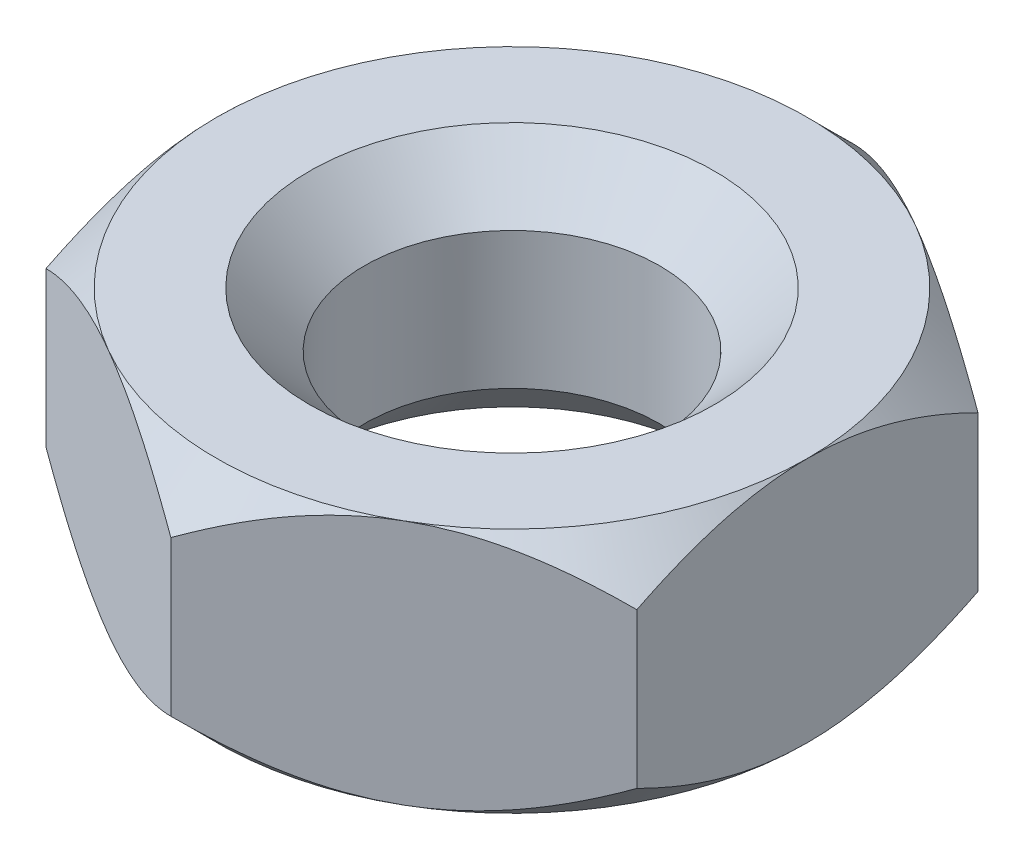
ISO-10303-21;
HEADER;
FILE_DESCRIPTION(('STEP AP214'),'2;1');
FILE_NAME('part.step','',(''),(''),'','','');
FILE_SCHEMA(('AUTOMOTIVE_DESIGN { 1 0 10303 214 1 1 1 1 }'));
ENDSEC;
DATA;
#1=APPLICATION_CONTEXT('core data for automotive mechanical design processes');
#2=APPLICATION_PROTOCOL_DEFINITION('international standard','automotive_design',2000,#1);
#3=PRODUCT_CONTEXT('',#1,'mechanical');
#4=PRODUCT('Part','Part','',(#3));
#5=PRODUCT_RELATED_PRODUCT_CATEGORY('part','',(#4));
#6=PRODUCT_DEFINITION_FORMATION('','',#4);
#7=PRODUCT_DEFINITION_CONTEXT('part definition',#1,'design');
#8=PRODUCT_DEFINITION('design','',#6,#7);
#9=PRODUCT_DEFINITION_SHAPE('','',#8);
#10=(LENGTH_UNIT() NAMED_UNIT(*) SI_UNIT(.MILLI.,.METRE.));
#11=(NAMED_UNIT(*) PLANE_ANGLE_UNIT() SI_UNIT($,.RADIAN.));
#12=(NAMED_UNIT(*) SI_UNIT($,.STERADIAN.) SOLID_ANGLE_UNIT());
#13=UNCERTAINTY_MEASURE_WITH_UNIT(LENGTH_MEASURE(1.E-05),#10,'distance_accuracy_value','');
#14=(GEOMETRIC_REPRESENTATION_CONTEXT(3) GLOBAL_UNCERTAINTY_ASSIGNED_CONTEXT((#13)) GLOBAL_UNIT_ASSIGNED_CONTEXT((#10,
#11,#12)) REPRESENTATION_CONTEXT('',''));
#15=CARTESIAN_POINT('',(0.,0.,0.));
#16=DIRECTION('',(0.,0.,1.));
#17=DIRECTION('',(1.,0.,0.));
#18=AXIS2_PLACEMENT_3D('',#15,#16,#17);
#19=CARTESIAN_POINT('',(0.,0.70480239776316,0.));
#20=DIRECTION('',(0.,-1.,0.));
#21=DIRECTION('',(0.,0.,-1.));
#22=AXIS2_PLACEMENT_3D('',#19,#20,#21);
#23=CONICAL_SURFACE('',#22,3.12019760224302,0.785398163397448);
#24=CARTESIAN_POINT('',(-1.22558165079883E-08,0.707308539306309,3.11769146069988));
#25=CARTESIAN_POINT('',(0.0933927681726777,0.761178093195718,3.06377111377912));
#26=CARTESIAN_POINT('',(0.188364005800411,0.811865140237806,3.00893944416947));
#27=CARTESIAN_POINT('',(0.382092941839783,0.904619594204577,2.89708999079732));
#28=CARTESIAN_POINT('',(0.480870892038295,0.946630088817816,2.84006051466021));
#29=CARTESIAN_POINT('',(0.678736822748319,1.01797353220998,2.72582256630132));
#30=CARTESIAN_POINT('',(0.777732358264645,1.04763944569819,2.6686674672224));
#31=CARTESIAN_POINT('',(0.977847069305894,1.09334614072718,2.55313118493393));
#32=CARTESIAN_POINT('',(1.07895877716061,1.10942854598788,2.49475431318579));
#33=CARTESIAN_POINT('',(1.20863181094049,1.12026667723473,2.41988755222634));
#34=CARTESIAN_POINT('',(1.23681517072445,1.12203543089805,2.4036158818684));
#35=CARTESIAN_POINT('',(1.29333046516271,1.12440395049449,2.37098676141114));
#36=CARTESIAN_POINT('',(1.32166254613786,1.12499905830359,2.35462922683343));
#37=CARTESIAN_POINT('',(1.35,1.12500000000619,2.33826859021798));
#38=B_SPLINE_CURVE_WITH_KNOTS('',3,(#24,#25,#26,#27,#28,#29,#30,#31,#32,#33,#34,#35,#36,#37),
.UNSPECIFIED.,.F.,.F.,(4,2,2,2,2,2,4),(0.,0.361907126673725,0.726117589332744,1.0797429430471,
1.43228071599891,1.5300396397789,1.6281857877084),.UNSPECIFIED.);
#39=CARTESIAN_POINT('',(-3.06182851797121E-08,0.707308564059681,3.1176914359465));
#40=VERTEX_POINT('',#39);
#41=CARTESIAN_POINT('',(1.35000000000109,1.125000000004,2.33826859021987));
#42=VERTEX_POINT('',#41);
#43=EDGE_CURVE('E123',#40,#42,#38,.T.);
#44=ORIENTED_EDGE('',*,*,#43,.T.);
#45=CARTESIAN_POINT('',(0.,1.12500000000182,0.));
#46=DIRECTION('',(0.,-1.,0.));
#47=DIRECTION('',(0.,0.,-1.));
#48=AXIS2_PLACEMENT_3D('',#45,#46,#47);
#49=CIRCLE('',#48,2.70000000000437);
#50=CARTESIAN_POINT('',(-1.35000000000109,1.125000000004,2.33826859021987));
#51=VERTEX_POINT('',#50);
#52=EDGE_CURVE('E130',#51,#42,#49,.F.);
#53=ORIENTED_EDGE('',*,*,#52,.F.);
#54=CARTESIAN_POINT('',(-1.35,1.12500000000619,2.33826859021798));
#55=CARTESIAN_POINT('',(-1.31408670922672,1.12500332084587,2.35900313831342));
#56=CARTESIAN_POINT('',(-1.27817878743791,1.12404413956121,2.37973458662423));
#57=CARTESIAN_POINT('',(-1.20644389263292,1.12023205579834,2.42115074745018));
#58=CARTESIAN_POINT('',(-1.17061690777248,1.11737945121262,2.44183546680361));
#59=CARTESIAN_POINT('',(-1.06348700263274,1.10604290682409,2.5036869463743));
#60=CARTESIAN_POINT('',(-0.992392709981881,1.09477998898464,2.54473325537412));
#61=CARTESIAN_POINT('',(-0.852359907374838,1.06566055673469,2.62558123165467));
#62=CARTESIAN_POINT('',(-0.783405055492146,1.04790604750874,2.66539233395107));
#63=CARTESIAN_POINT('',(-0.646803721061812,1.00657553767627,2.74425915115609));
#64=CARTESIAN_POINT('',(-0.579157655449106,0.982997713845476,2.7833146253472));
#65=CARTESIAN_POINT('',(-0.468526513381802,0.93991195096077,2.84718754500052));
#66=CARTESIAN_POINT('',(-0.4251183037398,0.921824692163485,2.87224928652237));
#67=CARTESIAN_POINT('',(-0.338937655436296,0.88376152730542,2.92200570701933));
#68=CARTESIAN_POINT('',(-0.296165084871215,0.863786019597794,2.94670046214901));
#69=CARTESIAN_POINT('',(-0.210800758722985,0.821942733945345,2.99598557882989));
#70=CARTESIAN_POINT('',(-0.16821544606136,0.800057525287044,3.0205722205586));
#71=CARTESIAN_POINT('',(-0.08365611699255,0.754771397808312,3.06939257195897));
#72=CARTESIAN_POINT('',(-0.0416820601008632,0.731370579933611,3.09362630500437));
#73=CARTESIAN_POINT('',(-6.12365688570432E-08,0.707308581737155,3.11769141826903));
#74=B_SPLINE_CURVE_WITH_KNOTS('',3,(#54,#55,#56,#57,#58,#59,#60,#61,#62,#63,#64,#65,#66,#67,#68,
#69,#70,#71,#72,#73),.UNSPECIFIED.,.F.,.F.,(4,2,2,2,2,2,2,2,2,4),(0.,0.124384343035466,
0.24874912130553,0.496987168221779,0.741481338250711,0.986052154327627,1.14587741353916,
1.30566903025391,1.46711292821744,1.62854608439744),.UNSPECIFIED.);
#75=EDGE_CURVE('E18',#51,#40,#74,.T.);
#76=ORIENTED_EDGE('',*,*,#75,.T.);
#77=EDGE_LOOP('',(#44,#53,#76));
#78=FACE_BOUND('',#77,.T.);
#79=ADVANCED_FACE('F14',(#78),#23,.T.);
#80=CARTESIAN_POINT('',(0.,0.70480239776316,0.));
#81=DIRECTION('',(0.,-1.,0.));
#82=DIRECTION('',(0.,0.,-1.));
#83=AXIS2_PLACEMENT_3D('',#80,#81,#82);
#84=CONICAL_SURFACE('',#83,3.12019760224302,0.785398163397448);
#85=CARTESIAN_POINT('',(2.70000001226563,0.70730853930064,-1.55884571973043));
#86=CARTESIAN_POINT('',(2.60660723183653,0.761178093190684,-1.61276606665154));
#87=CARTESIAN_POINT('',(2.51163599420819,0.811865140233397,-1.66759773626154));
#88=CARTESIAN_POINT('',(2.31790705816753,0.904619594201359,-1.77944718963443));
#89=CARTESIAN_POINT('',(2.21912910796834,0.946630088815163,-1.83647666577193));
#90=CARTESIAN_POINT('',(2.02126317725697,1.01797353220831,-1.9507146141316));
#91=CARTESIAN_POINT('',(1.92226764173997,1.04763944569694,-2.00786971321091));
#92=CARTESIAN_POINT('',(1.72215293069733,1.09334614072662,-2.12340599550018));
#93=CARTESIAN_POINT('',(1.62104122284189,1.10942854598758,-2.18178286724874));
#94=CARTESIAN_POINT('',(1.49136818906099,1.12026667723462,-2.25664962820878));
#95=CARTESIAN_POINT('',(1.46318482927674,1.12203543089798,-2.27292129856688));
#96=CARTESIAN_POINT('',(1.40666953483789,1.12440395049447,-2.30555041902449));
#97=CARTESIAN_POINT('',(1.37833745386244,1.12499905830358,-2.32190795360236));
#98=CARTESIAN_POINT('',(1.35,1.12500000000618,-2.33826859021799));
#99=B_SPLINE_CURVE_WITH_KNOTS('',3,(#85,#86,#87,#88,#89,#90,#91,#92,#93,#94,#95,#96,#97,#98),
.UNSPECIFIED.,.F.,.F.,(4,2,2,2,2,2,4),(0.,0.361907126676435,0.726117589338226,1.07974294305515,
1.43228071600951,1.53003963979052,1.62818578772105),.UNSPECIFIED.);
#100=CARTESIAN_POINT('',(2.7,0.707308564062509,-1.55884569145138));
#101=VERTEX_POINT('',#100);
#102=CARTESIAN_POINT('',(1.35000000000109,1.125000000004,-2.33826859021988));
#103=VERTEX_POINT('',#102);
#104=EDGE_CURVE('E177',#101,#103,#99,.T.);
#105=ORIENTED_EDGE('',*,*,#104,.T.);
#106=CARTESIAN_POINT('',(0.,1.12500000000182,0.));
#107=DIRECTION('',(0.,-1.,0.));
#108=DIRECTION('',(0.,0.,-1.));
#109=AXIS2_PLACEMENT_3D('',#106,#107,#108);
#110=CIRCLE('',#109,2.70000000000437);
#111=CARTESIAN_POINT('',(2.70000000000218,1.125000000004,0.));
#112=VERTEX_POINT('',#111);
#113=EDGE_CURVE('E137',#112,#103,#110,.F.);
#114=ORIENTED_EDGE('',*,*,#113,.F.);
#115=CARTESIAN_POINT('',(2.7,1.12500000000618,0.));
#116=CARTESIAN_POINT('',(2.7,1.12500332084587,-0.0414690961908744));
#117=CARTESIAN_POINT('',(2.7,1.12404413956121,-0.0829319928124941));
#118=CARTESIAN_POINT('',(2.7,1.12023205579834,-0.165764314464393));
#119=CARTESIAN_POINT('',(2.7,1.11737945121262,-0.207133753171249));
#120=CARTESIAN_POINT('',(2.7,1.10604290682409,-0.330836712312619));
#121=CARTESIAN_POINT('',(2.7,1.09477998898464,-0.412929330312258));
#122=CARTESIAN_POINT('',(2.7,1.06566055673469,-0.574625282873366));
#123=CARTESIAN_POINT('',(2.7,1.04790604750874,-0.654247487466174));
#124=CARTESIAN_POINT('',(2.7,1.00657553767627,-0.811981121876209));
#125=CARTESIAN_POINT('',(2.7,0.982997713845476,-0.890092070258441));
#126=CARTESIAN_POINT('',(2.7,0.93991195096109,-1.01783790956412));
#127=CARTESIAN_POINT('',(2.7,0.921824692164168,-1.06796139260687));
#128=CARTESIAN_POINT('',(2.7,0.883761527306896,-1.16747423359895));
#129=CARTESIAN_POINT('',(2.7,0.863786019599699,-1.2168637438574));
#130=CARTESIAN_POINT('',(2.7,0.821942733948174,-1.31543397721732));
#131=CARTESIAN_POINT('',(2.7,0.800057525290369,-1.36460726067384));
#132=CARTESIAN_POINT('',(2.7,0.754771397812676,-1.46224796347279));
#133=CARTESIAN_POINT('',(2.7,0.731370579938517,-1.5107154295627));
#134=CARTESIAN_POINT('',(2.7,0.707308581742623,-1.55884565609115));
#135=B_SPLINE_CURVE_WITH_KNOTS('',3,(#115,#116,#117,#118,#119,#120,#121,#122,#123,#124,#125,
#126,#127,#128,#129,#130,#131,#132,#133,#134),.UNSPECIFIED.,.F.,.F.,(4,2,2,2,2,2,2,2,2,4),(0.,
0.124384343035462,0.248749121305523,0.496987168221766,0.741481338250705,0.986052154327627,
1.14587741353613,1.30566903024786,1.4671129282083,1.62854608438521),.UNSPECIFIED.);
#136=EDGE_CURVE('E571',#112,#101,#135,.T.);
#137=ORIENTED_EDGE('',*,*,#136,.T.);
#138=EDGE_LOOP('',(#105,#114,#137));
#139=FACE_BOUND('',#138,.T.);
#140=ADVANCED_FACE('F164',(#139),#84,.T.);
#141=CARTESIAN_POINT('',(0.,0.70480239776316,0.));
#142=DIRECTION('',(0.,-1.,0.));
#143=DIRECTION('',(0.,0.,-1.));
#144=AXIS2_PLACEMENT_3D('',#141,#142,#143);
#145=CONICAL_SURFACE('',#144,3.12019760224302,0.785398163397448);
#146=CARTESIAN_POINT('',(-2.7,0.707308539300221,-1.55884574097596));
#147=CARTESIAN_POINT('',(-2.7,0.761178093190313,-1.4510050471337));
#148=CARTESIAN_POINT('',(-2.7,0.811865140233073,-1.34134170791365));
#149=CARTESIAN_POINT('',(-2.7,0.904619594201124,-1.11764280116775));
#150=CARTESIAN_POINT('',(-2.7,0.946630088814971,-1.00358384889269));
#151=CARTESIAN_POINT('',(-2.7,1.01797353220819,-0.775107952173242));
#152=CARTESIAN_POINT('',(-2.7,1.04763944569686,-0.66079775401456));
#153=CARTESIAN_POINT('',(-2.7,1.09334614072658,-0.429725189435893));
#154=CARTESIAN_POINT('',(-2.7,1.10942854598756,-0.312971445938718));
#155=CARTESIAN_POINT('',(-2.7,1.12026667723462,-0.163237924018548));
#156=CARTESIAN_POINT('',(-2.7,1.12203543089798,-0.130694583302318));
#157=CARTESIAN_POINT('',(-2.7,1.12440395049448,-0.0654363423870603));
#158=CARTESIAN_POINT('',(-2.7,1.12499905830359,-0.0327212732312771));
#159=CARTESIAN_POINT('',(-2.7,1.12500000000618,0.));
#160=B_SPLINE_CURVE_WITH_KNOTS('',3,(#146,#147,#148,#149,#150,#151,#152,#153,#154,#155,#156,
#157,#158,#159),.UNSPECIFIED.,.F.,.F.,(4,2,2,2,2,2,4),(0.,0.361907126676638,0.726117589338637,
1.07974294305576,1.43228071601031,1.53003963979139,1.628185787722),.UNSPECIFIED.);
#161=CARTESIAN_POINT('',(-2.69999996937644,0.707308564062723,-1.55884574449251));
#162=VERTEX_POINT('',#161);
#163=CARTESIAN_POINT('',(-2.70000000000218,1.125000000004,0.));
#164=VERTEX_POINT('',#163);
#165=EDGE_CURVE('E113',#162,#164,#160,.T.);
#166=ORIENTED_EDGE('',*,*,#165,.T.);
#167=CARTESIAN_POINT('',(0.,1.12500000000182,0.));
#168=DIRECTION('',(0.,-1.,0.));
#169=DIRECTION('',(0.,0.,-1.));
#170=AXIS2_PLACEMENT_3D('',#167,#168,#169);
#171=CIRCLE('',#170,2.70000000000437);
#172=CARTESIAN_POINT('',(-1.35000000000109,1.125000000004,-2.33826859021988));
#173=VERTEX_POINT('',#172);
#174=EDGE_CURVE('E134',#173,#164,#171,.F.);
#175=ORIENTED_EDGE('',*,*,#174,.F.);
#176=CARTESIAN_POINT('',(-1.35,1.12500000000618,-2.33826859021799));
#177=CARTESIAN_POINT('',(-1.38591329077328,1.12500332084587,-2.31753404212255));
#178=CARTESIAN_POINT('',(-1.42182121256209,1.12404413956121,-2.29680259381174));
#179=CARTESIAN_POINT('',(-1.49355610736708,1.12023205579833,-2.25538643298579));
#180=CARTESIAN_POINT('',(-1.52938309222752,1.11737945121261,-2.23470171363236));
#181=CARTESIAN_POINT('',(-1.63651299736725,1.10604290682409,-2.17285023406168));
#182=CARTESIAN_POINT('',(-1.70760729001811,1.09477998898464,-2.13180392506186));
#183=CARTESIAN_POINT('',(-1.84764009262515,1.06566055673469,-2.05095594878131));
#184=CARTESIAN_POINT('',(-1.91659494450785,1.04790604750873,-2.0111448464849));
#185=CARTESIAN_POINT('',(-2.05319627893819,1.00657553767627,-1.93227802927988));
#186=CARTESIAN_POINT('',(-2.12084234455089,0.982997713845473,-1.89322255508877));
#187=CARTESIAN_POINT('',(-2.23147348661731,0.939911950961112,-1.82934963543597));
#188=CARTESIAN_POINT('',(-2.27488169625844,0.921824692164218,-1.80428789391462));
#189=CARTESIAN_POINT('',(-2.36106234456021,0.883761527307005,-1.75453147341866));
#190=CARTESIAN_POINT('',(-2.40383491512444,0.863786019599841,-1.72983671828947));
#191=CARTESIAN_POINT('',(-2.48919924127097,0.821942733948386,-1.68055160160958));
#192=CARTESIAN_POINT('',(-2.53178455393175,0.800057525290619,-1.65596495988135));
#193=CARTESIAN_POINT('',(-2.61634388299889,0.754771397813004,-1.60714460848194));
#194=CARTESIAN_POINT('',(-2.65831793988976,0.731370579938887,-1.58291087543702));
#195=CARTESIAN_POINT('',(-2.69999993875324,0.707308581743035,-1.55884576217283));
#196=B_SPLINE_CURVE_WITH_KNOTS('',3,(#176,#177,#178,#179,#180,#181,#182,#183,#184,#185,#186,
#187,#188,#189,#190,#191,#192,#193,#194,#195),.UNSPECIFIED.,.F.,.F.,(4,2,2,2,2,2,2,2,2,4),(0.,
0.124384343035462,0.248749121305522,0.496987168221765,0.741481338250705,0.986052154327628,
1.1458774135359,1.3056690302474,1.46711292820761,1.62854608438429),.UNSPECIFIED.);
#197=EDGE_CURVE('E172',#173,#162,#196,.T.);
#198=ORIENTED_EDGE('',*,*,#197,.T.);
#199=EDGE_LOOP('',(#166,#175,#198));
#200=FACE_BOUND('',#199,.T.);
#201=ADVANCED_FACE('F159',(#200),#145,.T.);
#202=CARTESIAN_POINT('',(0.,0.70480239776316,0.));
#203=DIRECTION('',(0.,-1.,0.));
#204=DIRECTION('',(0.,0.,-1.));
#205=AXIS2_PLACEMENT_3D('',#202,#203,#204);
#206=CONICAL_SURFACE('',#205,3.12019760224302,0.785398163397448);
#207=CARTESIAN_POINT('',(0.,1.12500000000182,0.));
#208=DIRECTION('',(0.,-1.,0.));
#209=DIRECTION('',(0.,0.,-1.));
#210=AXIS2_PLACEMENT_3D('',#207,#208,#209);
#211=CIRCLE('',#210,2.70000000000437);
#212=EDGE_CURVE('E108',#164,#51,#211,.F.);
#213=ORIENTED_EDGE('',*,*,#212,.F.);
#214=CARTESIAN_POINT('',(-2.7,1.12500000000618,0.));
#215=CARTESIAN_POINT('',(-2.7,1.12500332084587,0.0414690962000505));
#216=CARTESIAN_POINT('',(-2.7,1.12404413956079,0.0829319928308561));
#217=CARTESIAN_POINT('',(-2.7,1.12023205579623,0.16576431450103));
#218=CARTESIAN_POINT('',(-2.7,1.11737945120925,0.207133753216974));
#219=CARTESIAN_POINT('',(-2.7,1.10604290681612,0.330836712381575));
#220=CARTESIAN_POINT('',(-2.7,1.09477998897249,0.412929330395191));
#221=CARTESIAN_POINT('',(-2.7,1.06566055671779,0.574625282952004));
#222=CARTESIAN_POINT('',(-2.7,1.04790604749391,0.654247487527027));
#223=CARTESIAN_POINT('',(-2.7,1.00657553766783,0.811981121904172));
#224=CARTESIAN_POINT('',(-2.7,0.982997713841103,0.89009207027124));
#225=CARTESIAN_POINT('',(-2.7,0.939911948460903,1.01783791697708));
#226=CARTESIAN_POINT('',(-2.7,0.921824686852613,1.06796140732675));
#227=CARTESIAN_POINT('',(-2.7,0.883761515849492,1.16747426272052));
#228=CARTESIAN_POINT('',(-2.7,0.863786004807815,1.21686378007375));
#229=CARTESIAN_POINT('',(-2.7,0.821942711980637,1.31543402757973));
#230=CARTESIAN_POINT('',(-2.7,0.800057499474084,1.36460731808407));
#231=CARTESIAN_POINT('',(-2.7,0.754771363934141,1.46224803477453));
#232=CARTESIAN_POINT('',(-2.7,0.731370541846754,1.51071550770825));
#233=CARTESIAN_POINT('',(-2.7,0.707308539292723,1.55884574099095));
#234=B_SPLINE_CURVE_WITH_KNOTS('',3,(#214,#215,#216,#217,#218,#219,#220,#221,#222,#223,#224,
#225,#226,#227,#228,#229,#230,#231,#232,#233),.UNSPECIFIED.,.F.,.F.,(4,2,2,2,2,2,2,2,2,4),(0.,
0.124384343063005,0.248749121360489,0.49698716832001,0.741481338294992,0.986052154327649,
1.14587743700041,1.30566907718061,1.46711299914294,1.62854617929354),.UNSPECIFIED.);
#235=CARTESIAN_POINT('',(-2.7,0.707308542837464,1.55884573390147));
#236=VERTEX_POINT('',#235);
#237=EDGE_CURVE('E110',#164,#236,#234,.T.);
#238=ORIENTED_EDGE('',*,*,#237,.T.);
#239=CARTESIAN_POINT('',(-2.69999993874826,0.707308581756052,1.55884576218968));
#240=CARTESIAN_POINT('',(-2.60660716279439,0.761178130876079,1.61276610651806));
#241=CARTESIAN_POINT('',(-2.51163592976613,0.811865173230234,1.66759777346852));
#242=CARTESIAN_POINT('',(-2.31790700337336,0.904619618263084,1.77944722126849));
#243=CARTESIAN_POINT('',(-2.21912905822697,0.946630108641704,1.83647669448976));
#244=CARTESIAN_POINT('',(-2.02126313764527,1.01797354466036,1.95071463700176));
#245=CARTESIAN_POINT('',(-1.9222676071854,1.04763945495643,2.00786973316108));
#246=CARTESIAN_POINT('',(-1.72215290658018,1.09334614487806,2.12340600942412));
#247=CARTESIAN_POINT('',(-1.62104120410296,1.10942854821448,2.18178287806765));
#248=CARTESIAN_POINT('',(-1.49136817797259,1.12026667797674,2.25664963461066));
#249=CARTESIAN_POINT('',(-1.46318482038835,1.12203543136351,2.27292130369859));
#250=CARTESIAN_POINT('',(-1.40666953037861,1.12440395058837,2.30555042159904));
#251=CARTESIAN_POINT('',(-1.37833745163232,1.12499905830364,2.32190795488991));
#252=CARTESIAN_POINT('',(-1.35,1.12500000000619,2.33826859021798));
#253=B_SPLINE_CURVE_WITH_KNOTS('',3,(#239,#240,#241,#242,#243,#244,#245,#246,#247,#248,#249,
#250,#251,#252),.UNSPECIFIED.,.F.,.F.,(4,2,2,2,2,2,4),(0.,0.361907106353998,0.726117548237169,
1.07974288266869,1.43228063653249,1.53003955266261,1.62818569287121),.UNSPECIFIED.);
#254=EDGE_CURVE('E104',#236,#51,#253,.T.);
#255=ORIENTED_EDGE('',*,*,#254,.T.);
#256=EDGE_LOOP('',(#213,#238,#255));
#257=FACE_BOUND('',#256,.T.);
#258=ADVANCED_FACE('F106',(#257),#206,.T.);
#259=CARTESIAN_POINT('',(0.,1.125,0.));
#260=DIRECTION('',(0.,1.,0.));
#261=DIRECTION('',(0.,0.,1.));
#262=AXIS2_PLACEMENT_3D('',#259,#260,#261);
#263=PLANE('',#262);
#264=ORIENTED_EDGE('',*,*,#174,.T.);
#265=ORIENTED_EDGE('',*,*,#212,.T.);
#266=ORIENTED_EDGE('',*,*,#52,.T.);
#267=CARTESIAN_POINT('',(0.,1.12500000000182,0.));
#268=DIRECTION('',(0.,-1.,0.));
#269=DIRECTION('',(0.,0.,-1.));
#270=AXIS2_PLACEMENT_3D('',#267,#268,#269);
#271=CIRCLE('',#270,2.70000000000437);
#272=EDGE_CURVE('E337',#112,#42,#271,.T.);
#273=ORIENTED_EDGE('',*,*,#272,.F.);
#274=ORIENTED_EDGE('',*,*,#113,.T.);
#275=CARTESIAN_POINT('',(0.,1.12500000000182,0.));
#276=DIRECTION('',(0.,-1.,0.));
#277=DIRECTION('',(0.,0.,-1.));
#278=AXIS2_PLACEMENT_3D('',#275,#276,#277);
#279=CIRCLE('',#278,2.70000000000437);
#280=EDGE_CURVE('E421',#173,#103,#279,.T.);
#281=ORIENTED_EDGE('',*,*,#280,.F.);
#282=EDGE_LOOP('',(#264,#265,#266,#273,#274,#281));
#283=FACE_BOUND('',#282,.T.);
#284=CARTESIAN_POINT('',(0.,1.12499999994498,0.));
#285=DIRECTION('',(0.,1.,0.));
#286=DIRECTION('',(0.,0.,1.));
#287=AXIS2_PLACEMENT_3D('',#284,#285,#286);
#288=CIRCLE('',#287,1.8500000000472);
#289=CARTESIAN_POINT('',(0.,1.12499999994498,1.8500000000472));
#290=VERTEX_POINT('',#289);
#291=EDGE_CURVE('E135',#290,#290,#288,.F.);
#292=ORIENTED_EDGE('',*,*,#291,.T.);
#293=EDGE_LOOP('',(#292));
#294=FACE_BOUND('',#293,.T.);
#295=ADVANCED_FACE('F127',(#283,#294),#263,.T.);
#296=CARTESIAN_POINT('',(0.,1.12499999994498,0.));
#297=DIRECTION('',(0.,1.,0.));
#298=DIRECTION('',(0.,0.,1.));
#299=AXIS2_PLACEMENT_3D('',#296,#297,#298);
#300=CONICAL_SURFACE('',#299,1.8500000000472,0.785398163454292);
#301=ORIENTED_EDGE('',*,*,#291,.F.);
#302=EDGE_LOOP('',(#301));
#303=FACE_BOUND('',#302,.T.);
#304=CARTESIAN_POINT('',(0.,0.625000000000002,0.));
#305=DIRECTION('',(0.,-1.,0.));
#306=DIRECTION('',(0.,0.,-1.));
#307=AXIS2_PLACEMENT_3D('',#304,#305,#306);
#308=CIRCLE('',#307,1.35);
#309=CARTESIAN_POINT('',(0.,0.625000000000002,-1.35));
#310=VERTEX_POINT('',#309);
#311=EDGE_CURVE('E335',#310,#310,#308,.T.);
#312=ORIENTED_EDGE('',*,*,#311,.T.);
#313=EDGE_LOOP('',(#312));
#314=FACE_BOUND('',#313,.T.);
#315=ADVANCED_FACE('F234',(#303,#314),#300,.F.);
#316=CARTESIAN_POINT('',(0.,0.70480239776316,0.));
#317=DIRECTION('',(0.,-1.,0.));
#318=DIRECTION('',(0.,0.,-1.));
#319=AXIS2_PLACEMENT_3D('',#316,#317,#318);
#320=CONICAL_SURFACE('',#319,3.12019760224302,0.785398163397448);
#321=ORIENTED_EDGE('',*,*,#280,.T.);
#322=CARTESIAN_POINT('',(1.35,1.12500000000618,-2.33826859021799));
#323=CARTESIAN_POINT('',(1.31408670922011,1.12500332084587,-2.35900313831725));
#324=CARTESIAN_POINT('',(1.27817878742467,1.12404413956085,-2.37973458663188));
#325=CARTESIAN_POINT('',(1.2064438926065,1.12023205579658,-2.42115074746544));
#326=CARTESIAN_POINT('',(1.1706169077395,1.11737945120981,-2.44183546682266));
#327=CARTESIAN_POINT('',(1.06348700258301,1.10604290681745,-2.50368694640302));
#328=CARTESIAN_POINT('',(0.992392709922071,1.09477998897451,-2.54473325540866));
#329=CARTESIAN_POINT('',(0.852359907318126,1.06566055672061,-2.62558123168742));
#330=CARTESIAN_POINT('',(0.783405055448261,1.04790604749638,-2.66539233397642));
#331=CARTESIAN_POINT('',(0.646803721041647,1.00657553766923,-2.74425915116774));
#332=CARTESIAN_POINT('',(0.579157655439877,0.982997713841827,-2.78331462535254));
#333=CARTESIAN_POINT('',(0.468526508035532,0.939911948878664,-2.8471875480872));
#334=CARTESIAN_POINT('',(0.425118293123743,0.921824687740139,-2.87224929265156));
#335=CARTESIAN_POINT('',(0.338937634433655,0.883761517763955,-2.92200571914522));
#336=CARTESIAN_POINT('',(0.296165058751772,0.863786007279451,-2.94670047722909));
#337=CARTESIAN_POINT('',(0.210800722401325,0.821942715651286,-2.99598559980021));
#338=CARTESIAN_POINT('',(0.168215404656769,0.800057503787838,-3.02057224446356));
#339=CARTESIAN_POINT('',(0.0836560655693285,0.754771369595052,-3.06939260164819));
#340=CARTESIAN_POINT('',(0.041682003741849,0.731370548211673,-3.09362633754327));
#341=CARTESIAN_POINT('',(6.34920683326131E-12,0.707308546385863,-3.11769145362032));
#342=B_SPLINE_CURVE_WITH_KNOTS('',3,(#322,#323,#324,#325,#326,#327,#328,#329,#330,#331,#332,
#333,#334,#335,#336,#337,#338,#339,#340,#341),.UNSPECIFIED.,.F.,.F.,(4,2,2,2,2,2,2,2,2,4),(0.,
0.124384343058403,0.248749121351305,0.496987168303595,0.741481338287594,0.986052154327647,
1.14587743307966,1.30566906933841,1.46711298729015,1.62854616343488),.UNSPECIFIED.);
#343=CARTESIAN_POINT('',(0.,0.707308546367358,-3.1176914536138));
#344=VERTEX_POINT('',#343);
#345=EDGE_CURVE('E225',#103,#344,#342,.T.);
#346=ORIENTED_EDGE('',*,*,#345,.T.);
#347=CARTESIAN_POINT('',(-6.34970562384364E-12,0.707308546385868,-3.11769145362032));
#348=CARTESIAN_POINT('',(-0.0933927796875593,0.761178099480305,-3.063771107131));
#349=CARTESIAN_POINT('',(-0.188364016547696,0.81186514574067,-3.00893943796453));
#350=CARTESIAN_POINT('',(-0.382092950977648,0.904619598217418,-2.89708998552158));
#351=CARTESIAN_POINT('',(-0.480870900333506,0.946630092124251,-2.84006050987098));
#352=CARTESIAN_POINT('',(-0.678736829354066,1.01797353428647,-2.7258225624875));
#353=CARTESIAN_POINT('',(-0.777732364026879,1.04763944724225,-2.66866746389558));
#354=CARTESIAN_POINT('',(-0.977847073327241,1.09334614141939,-2.55313118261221));
#355=CARTESIAN_POINT('',(-1.07895878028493,1.10942854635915,-2.49475431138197));
#356=CARTESIAN_POINT('',(-1.20863181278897,1.12026667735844,-2.41988755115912));
#357=CARTESIAN_POINT('',(-1.23681517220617,1.12203543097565,-2.40361588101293));
#358=CARTESIAN_POINT('',(-1.29333046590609,1.12440395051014,-2.37098676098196));
#359=CARTESIAN_POINT('',(-1.32166254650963,1.12499905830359,-2.3546292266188));
#360=CARTESIAN_POINT('',(-1.35,1.12500000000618,-2.33826859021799));
#361=B_SPLINE_CURVE_WITH_KNOTS('',3,(#347,#348,#349,#350,#351,#352,#353,#354,#355,#356,#357,
#358,#359,#360),.UNSPECIFIED.,.F.,.F.,(4,2,2,2,2,2,4),(0.,0.361907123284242,0.726117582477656,
1.0797429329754,1.43228070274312,1.53003962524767,1.6281857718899),.UNSPECIFIED.);
#362=EDGE_CURVE('E208',#344,#173,#361,.T.);
#363=ORIENTED_EDGE('',*,*,#362,.T.);
#364=EDGE_LOOP('',(#321,#346,#363));
#365=FACE_BOUND('',#364,.T.);
#366=ADVANCED_FACE('F230',(#365),#320,.T.);
#367=CARTESIAN_POINT('',(0.,0.70480239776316,0.));
#368=DIRECTION('',(0.,-1.,0.));
#369=DIRECTION('',(0.,0.,-1.));
#370=AXIS2_PLACEMENT_3D('',#367,#368,#369);
#371=CONICAL_SURFACE('',#370,3.12019760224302,0.785398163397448);
#372=CARTESIAN_POINT('',(2.7,0.70730854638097,1.55884572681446));
#373=CARTESIAN_POINT('',(2.7,0.761178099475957,1.45100503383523));
#374=CARTESIAN_POINT('',(2.7,0.811865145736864,1.34134169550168));
#375=CARTESIAN_POINT('',(2.7,0.904619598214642,1.11764279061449));
#376=CARTESIAN_POINT('',(2.7,0.946630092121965,1.0035838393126));
#377=CARTESIAN_POINT('',(2.7,1.01797353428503,0.775107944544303));
#378=CARTESIAN_POINT('',(2.7,1.04763944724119,0.66079774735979));
#379=CARTESIAN_POINT('',(2.7,1.09334614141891,0.429725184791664));
#380=CARTESIAN_POINT('',(2.7,1.1094285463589,0.312971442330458));
#381=CARTESIAN_POINT('',(2.7,1.12026667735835,0.16323792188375));
#382=CARTESIAN_POINT('',(2.7,1.1220354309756,0.130694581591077));
#383=CARTESIAN_POINT('',(2.7,1.12440395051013,0.0654363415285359));
#384=CARTESIAN_POINT('',(2.7,1.12499905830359,0.0327212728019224));
#385=CARTESIAN_POINT('',(2.7,1.12500000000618,0.));
#386=B_SPLINE_CURVE_WITH_KNOTS('',3,(#372,#373,#374,#375,#376,#377,#378,#379,#380,#381,#382,
#383,#384,#385),.UNSPECIFIED.,.F.,.F.,(4,2,2,2,2,2,4),(0.,0.361907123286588,0.726117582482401,
1.07974293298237,1.43228070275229,1.53003962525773,1.62818577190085),.UNSPECIFIED.);
#387=CARTESIAN_POINT('',(2.7,0.707308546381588,1.55884572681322));
#388=VERTEX_POINT('',#387);
#389=EDGE_CURVE('E218',#388,#112,#386,.T.);
#390=ORIENTED_EDGE('',*,*,#389,.T.);
#391=ORIENTED_EDGE('',*,*,#272,.T.);
#392=CARTESIAN_POINT('',(1.35,1.12500000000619,2.33826859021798));
#393=CARTESIAN_POINT('',(1.3859132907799,1.12500332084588,2.31753404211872));
#394=CARTESIAN_POINT('',(1.42182121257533,1.12404413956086,2.29680259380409));
#395=CARTESIAN_POINT('',(1.49355610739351,1.12023205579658,2.25538643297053));
#396=CARTESIAN_POINT('',(1.5293830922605,1.11737945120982,2.23470171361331));
#397=CARTESIAN_POINT('',(1.636512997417,1.10604290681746,2.17285023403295));
#398=CARTESIAN_POINT('',(1.70760729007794,1.09477998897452,2.13180392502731));
#399=CARTESIAN_POINT('',(1.84764009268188,1.06566055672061,2.05095594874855));
#400=CARTESIAN_POINT('',(1.91659494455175,1.04790604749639,2.01114484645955));
#401=CARTESIAN_POINT('',(2.05319627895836,1.00657553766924,1.93227802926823));
#402=CARTESIAN_POINT('',(2.12084234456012,0.982997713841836,1.89322255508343));
#403=CARTESIAN_POINT('',(2.23147349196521,0.939911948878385,1.82934963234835));
#404=CARTESIAN_POINT('',(2.27488170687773,0.921824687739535,1.80428788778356));
#405=CARTESIAN_POINT('',(2.36106236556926,0.883761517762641,1.75453146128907));
#406=CARTESIAN_POINT('',(2.40383494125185,0.863786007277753,1.72983670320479));
#407=CARTESIAN_POINT('',(2.48919927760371,0.821942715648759,1.68055158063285));
#408=CARTESIAN_POINT('',(2.53178459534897,0.800057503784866,1.6559649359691));
#409=CARTESIAN_POINT('',(2.6163439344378,0.754771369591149,1.60714457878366));
#410=CARTESIAN_POINT('',(2.65831799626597,0.731370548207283,1.58291084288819));
#411=CARTESIAN_POINT('',(2.70000000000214,0.70730854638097,1.55884572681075));
#412=B_SPLINE_CURVE_WITH_KNOTS('',3,(#392,#393,#394,#395,#396,#397,#398,#399,#400,#401,#402,
#403,#404,#405,#406,#407,#408,#409,#410,#411),.UNSPECIFIED.,.F.,.F.,(4,2,2,2,2,2,2,2,2,4),(0.,
0.124384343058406,0.24874912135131,0.496987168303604,0.741481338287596,0.986052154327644,
1.14587743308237,1.30566906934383,1.46711298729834,1.62854616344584),.UNSPECIFIED.);
#413=EDGE_CURVE('E303',#42,#388,#412,.T.);
#414=ORIENTED_EDGE('',*,*,#413,.T.);
#415=EDGE_LOOP('',(#390,#391,#414));
#416=FACE_BOUND('',#415,.T.);
#417=ADVANCED_FACE('F233',(#416),#371,.T.);
#418=CARTESIAN_POINT('',(0.,1.125,0.));
#419=DIRECTION('',(0.,-1.,0.));
#420=DIRECTION('',(0.,0.,-1.));
#421=AXIS2_PLACEMENT_3D('',#418,#419,#420);
#422=CYLINDRICAL_SURFACE('',#421,1.35);
#423=CARTESIAN_POINT('',(0.,-0.625000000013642,0.));
#424=DIRECTION('',(0.,-1.,0.));
#425=DIRECTION('',(0.,0.,-1.));
#426=AXIS2_PLACEMENT_3D('',#423,#424,#425);
#427=CIRCLE('',#426,1.35000000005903);
#428=CARTESIAN_POINT('',(0.,-0.625000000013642,-1.35000000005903));
#429=VERTEX_POINT('',#428);
#430=EDGE_CURVE('E299',#429,#429,#427,.T.);
#431=ORIENTED_EDGE('',*,*,#430,.T.);
#432=EDGE_LOOP('',(#431));
#433=FACE_BOUND('',#432,.T.);
#434=ORIENTED_EDGE('',*,*,#311,.F.);
#435=EDGE_LOOP('',(#434));
#436=FACE_BOUND('',#435,.T.);
#437=ADVANCED_FACE('F510',(#433,#436),#422,.F.);
#438=CARTESIAN_POINT('',(2.7,1.125,-1.558845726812));
#439=DIRECTION('',(-0.5,0.,0.866025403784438));
#440=DIRECTION('',(0.866025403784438,0.,0.5));
#441=AXIS2_PLACEMENT_3D('',#438,#439,#440);
#442=PLANE('',#441);
#443=DIRECTION('',(0.,1.,0.));
#444=VECTOR('',#443,1.);
#445=CARTESIAN_POINT('',(0.,1.125,-3.11769145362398));
#446=LINE('',#445,#444);
#447=CARTESIAN_POINT('',(-1.46662531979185E-12,-0.707308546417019,-3.11769145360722));
#448=VERTEX_POINT('',#447);
#449=EDGE_CURVE('E217',#448,#344,#446,.T.);
#450=ORIENTED_EDGE('',*,*,#449,.T.);
#451=ORIENTED_EDGE('',*,*,#345,.F.);
#452=ORIENTED_EDGE('',*,*,#104,.F.);
#453=DIRECTION('',(0.,1.,0.));
#454=VECTOR('',#453,1.);
#455=CARTESIAN_POINT('',(2.7,1.125,-1.558845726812));
#456=LINE('',#455,#454);
#457=CARTESIAN_POINT('',(2.70000000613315,-0.707308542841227,-1.55884572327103));
#458=VERTEX_POINT('',#457);
#459=EDGE_CURVE('E410',#101,#458,#456,.F.);
#460=ORIENTED_EDGE('',*,*,#459,.T.);
#461=CARTESIAN_POINT('',(1.35,-1.12500000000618,-2.33826859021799));
#462=CARTESIAN_POINT('',(1.38591329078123,-1.12500332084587,-2.31753404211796));
#463=CARTESIAN_POINT('',(1.42182121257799,-1.12404413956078,-2.29680259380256));
#464=CARTESIAN_POINT('',(1.4935561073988,-1.12023205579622,-2.25538643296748));
#465=CARTESIAN_POINT('',(1.52938309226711,-1.11737945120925,-2.23470171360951));
#466=CARTESIAN_POINT('',(1.63651299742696,-1.10604290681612,-2.17285023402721));
#467=CARTESIAN_POINT('',(1.70760729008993,-1.09477998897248,-2.1318039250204));
#468=CARTESIAN_POINT('',(1.84764009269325,-1.06566055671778,-2.05095594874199));
#469=CARTESIAN_POINT('',(1.91659494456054,-1.04790604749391,-2.01114484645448));
#470=CARTESIAN_POINT('',(2.0531962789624,-1.00657553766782,-1.93227802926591));
#471=CARTESIAN_POINT('',(2.12084234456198,-0.982997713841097,-1.89322255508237));
#472=CARTESIAN_POINT('',(2.23147349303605,-0.939911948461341,-1.82934963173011));
#473=CARTESIAN_POINT('',(2.27488170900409,-0.921824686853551,-1.80428788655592));
#474=CARTESIAN_POINT('',(2.361062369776,-0.88376151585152,-1.75453145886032));
#475=CARTESIAN_POINT('',(2.40383494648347,-0.863786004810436,-1.72983670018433));
#476=CARTESIAN_POINT('',(2.48919928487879,-0.821942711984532,-1.68055157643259));
#477=CARTESIAN_POINT('',(2.53178460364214,-0.800057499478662,-1.65596493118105));
#478=CARTESIAN_POINT('',(2.61634394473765,-0.75477136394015,-1.60714457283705));
#479=CARTESIAN_POINT('',(2.65831800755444,-0.731370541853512,-1.5829108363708));
#480=CARTESIAN_POINT('',(2.70000001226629,-0.707308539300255,-1.55884571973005));
#481=B_SPLINE_CURVE_WITH_KNOTS('',3,(#461,#462,#463,#464,#465,#466,#467,#468,#469,#470,#471,
#472,#473,#474,#475,#476,#477,#478,#479,#480),.UNSPECIFIED.,.F.,.F.,(4,2,2,2,2,2,2,2,2,4),(0.,
0.124384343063,0.248749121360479,0.496987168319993,0.741481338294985,0.98605215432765,
1.14587743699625,1.30566907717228,1.46711299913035,1.62854617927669),.UNSPECIFIED.);
#482=CARTESIAN_POINT('',(1.35000000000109,-1.125000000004,-2.33826859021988));
#483=VERTEX_POINT('',#482);
#484=EDGE_CURVE('E298',#483,#458,#481,.T.);
#485=ORIENTED_EDGE('',*,*,#484,.F.);
#486=CARTESIAN_POINT('',(-2.92902419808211E-12,-0.707308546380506,-3.11769145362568));
#487=CARTESIAN_POINT('',(0.0933927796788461,-0.761178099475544,-3.06377110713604));
#488=CARTESIAN_POINT('',(0.188364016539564,-0.811865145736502,-3.00893943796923));
#489=CARTESIAN_POINT('',(0.382092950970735,-0.904619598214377,-2.89708998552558));
#490=CARTESIAN_POINT('',(0.48087090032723,-0.946630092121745,-2.8400605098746));
#491=CARTESIAN_POINT('',(0.678736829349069,-1.01797353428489,-2.72582256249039));
#492=CARTESIAN_POINT('',(0.777732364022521,-1.04763944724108,-2.6686674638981));
#493=CARTESIAN_POINT('',(0.9778470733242,-1.09334614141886,-2.55313118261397));
#494=CARTESIAN_POINT('',(1.07895878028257,-1.10942854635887,-2.49475431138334));
#495=CARTESIAN_POINT('',(1.20863181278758,-1.12026667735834,-2.41988755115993));
#496=CARTESIAN_POINT('',(1.23681517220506,-1.12203543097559,-2.40361588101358));
#497=CARTESIAN_POINT('',(1.29333046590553,-1.12440395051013,-2.37098676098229));
#498=CARTESIAN_POINT('',(1.32166254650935,-1.12499905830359,-2.35462922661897));
#499=CARTESIAN_POINT('',(1.35,-1.12500000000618,-2.33826859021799));
#500=B_SPLINE_CURVE_WITH_KNOTS('',3,(#486,#487,#488,#489,#490,#491,#492,#493,#494,#495,#496,
#497,#498,#499),.UNSPECIFIED.,.F.,.F.,(4,2,2,2,2,2,4),(0.,0.361907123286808,0.726117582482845,
1.07974293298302,1.43228070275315,1.53003962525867,1.62818577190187),.UNSPECIFIED.);
#501=EDGE_CURVE('E401',#448,#483,#500,.T.);
#502=ORIENTED_EDGE('',*,*,#501,.F.);
#503=EDGE_LOOP('',(#450,#451,#452,#460,#485,#502));
#504=FACE_BOUND('',#503,.T.);
#505=ADVANCED_FACE('F186',(#504),#442,.F.);
#506=CARTESIAN_POINT('',(0.,1.125,-3.11769145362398));
#507=DIRECTION('',(0.5,0.,0.866025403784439));
#508=DIRECTION('',(0.866025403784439,0.,-0.5));
#509=AXIS2_PLACEMENT_3D('',#506,#507,#508);
#510=PLANE('',#509);
#511=DIRECTION('',(0.,1.,0.));
#512=VECTOR('',#511,1.);
#513=CARTESIAN_POINT('',(-2.7,1.125,-1.55884572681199));
#514=LINE('',#513,#512);
#515=CARTESIAN_POINT('',(-2.7,-0.707308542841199,-1.558845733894));
#516=VERTEX_POINT('',#515);
#517=EDGE_CURVE('E216',#516,#162,#514,.T.);
#518=ORIENTED_EDGE('',*,*,#517,.T.);
#519=ORIENTED_EDGE('',*,*,#197,.F.);
#520=ORIENTED_EDGE('',*,*,#362,.F.);
#521=ORIENTED_EDGE('',*,*,#449,.F.);
#522=CARTESIAN_POINT('',(-1.35,-1.12500000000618,-2.33826859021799));
#523=CARTESIAN_POINT('',(-1.3140867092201,-1.12500332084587,-2.35900313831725));
#524=CARTESIAN_POINT('',(-1.27817878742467,-1.12404413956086,-2.37973458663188));
#525=CARTESIAN_POINT('',(-1.20644389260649,-1.12023205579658,-2.42115074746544));
#526=CARTESIAN_POINT('',(-1.1706169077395,-1.11737945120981,-2.44183546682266));
#527=CARTESIAN_POINT('',(-1.063487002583,-1.10604290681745,-2.50368694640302));
#528=CARTESIAN_POINT('',(-0.992392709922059,-1.09477998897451,-2.54473325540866));
#529=CARTESIAN_POINT('',(-0.852359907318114,-1.06566055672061,-2.62558123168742));
#530=CARTESIAN_POINT('',(-0.783405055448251,-1.04790604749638,-2.66539233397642));
#531=CARTESIAN_POINT('',(-0.646803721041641,-1.00657553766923,-2.74425915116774));
#532=CARTESIAN_POINT('',(-0.579157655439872,-0.98299771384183,-2.78331462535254));
#533=CARTESIAN_POINT('',(-0.468526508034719,-0.939911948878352,-2.84718754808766));
#534=CARTESIAN_POINT('',(-0.425118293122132,-0.921824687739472,-2.87224929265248));
#535=CARTESIAN_POINT('',(-0.33893763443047,-0.883761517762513,-2.92200571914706));
#536=CARTESIAN_POINT('',(-0.296165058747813,-0.863786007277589,-2.94670047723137));
#537=CARTESIAN_POINT('',(-0.210800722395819,-0.821942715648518,-2.99598559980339));
#538=CARTESIAN_POINT('',(-0.168215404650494,-0.800057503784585,-3.02057224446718));
#539=CARTESIAN_POINT('',(-0.0836560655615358,-0.754771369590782,-3.06939260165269));
#540=CARTESIAN_POINT('',(-0.0416820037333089,-0.731370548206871,-3.09362633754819));
#541=CARTESIAN_POINT('',(2.92872523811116E-12,-0.707308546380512,-3.11769145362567));
#542=B_SPLINE_CURVE_WITH_KNOTS('',3,(#522,#523,#524,#525,#526,#527,#528,#529,#530,#531,#532,
#533,#534,#535,#536,#537,#538,#539,#540,#541),.UNSPECIFIED.,.F.,.F.,(4,2,2,2,2,2,2,2,2,4),(0.,
0.124384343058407,0.248749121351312,0.496987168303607,0.741481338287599,0.986052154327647,
1.14587743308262,1.30566906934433,1.4671129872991,1.62854616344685),.UNSPECIFIED.);
#543=CARTESIAN_POINT('',(-1.35000000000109,-1.125000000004,-2.33826859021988));
#544=VERTEX_POINT('',#543);
#545=EDGE_CURVE('E201',#544,#448,#542,.T.);
#546=ORIENTED_EDGE('',*,*,#545,.F.);
#547=CARTESIAN_POINT('',(-2.69999993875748,-0.707308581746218,-1.55884576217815));
#548=CARTESIAN_POINT('',(-2.60660716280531,-0.76117813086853,-1.61276610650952));
#549=CARTESIAN_POINT('',(-2.51163592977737,-0.811865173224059,-1.66759777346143));
#550=CARTESIAN_POINT('',(-2.31790700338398,-0.904619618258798,-1.77944722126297));
#551=CARTESIAN_POINT('',(-2.21912905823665,-0.946630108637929,-1.83647669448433));
#552=CARTESIAN_POINT('',(-2.02126313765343,-1.01797354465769,-1.9507146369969));
#553=CARTESIAN_POINT('',(-1.92226760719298,-1.04763945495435,-2.00786973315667));
#554=CARTESIAN_POINT('',(-1.72215290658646,-1.09334614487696,-2.12340600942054));
#555=CARTESIAN_POINT('',(-1.62104120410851,-1.10942854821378,-2.18178287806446));
#556=CARTESIAN_POINT('',(-1.49136817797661,-1.12026667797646,-2.25664963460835));
#557=CARTESIAN_POINT('',(-1.46318482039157,-1.12203543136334,-2.27292130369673));
#558=CARTESIAN_POINT('',(-1.40666953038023,-1.12440395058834,-2.30555042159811));
#559=CARTESIAN_POINT('',(-1.37833745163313,-1.12499905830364,-2.32190795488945));
#560=CARTESIAN_POINT('',(-1.35,-1.12500000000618,-2.33826859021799));
#561=B_SPLINE_CURVE_WITH_KNOTS('',3,(#547,#548,#549,#550,#551,#552,#553,#554,#555,#556,#557,
#558,#559,#560),.UNSPECIFIED.,.F.,.F.,(4,2,2,2,2,2,4),(0.,0.361907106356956,0.726117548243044,
1.07974288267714,1.43228063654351,1.5300395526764,1.62818569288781),.UNSPECIFIED.);
#562=EDGE_CURVE('E193',#516,#544,#561,.T.);
#563=ORIENTED_EDGE('',*,*,#562,.F.);
#564=EDGE_LOOP('',(#518,#519,#520,#521,#546,#563));
#565=FACE_BOUND('',#564,.T.);
#566=ADVANCED_FACE('F183',(#565),#510,.F.);
#567=CARTESIAN_POINT('',(-2.7,1.125,-1.55884572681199));
#568=DIRECTION('',(1.,0.,0.));
#569=DIRECTION('',(0.,0.,-1.));
#570=AXIS2_PLACEMENT_3D('',#567,#568,#569);
#571=PLANE('',#570);
#572=DIRECTION('',(0.,1.,0.));
#573=VECTOR('',#572,1.);
#574=CARTESIAN_POINT('',(-2.7,1.125,1.55884572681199));
#575=LINE('',#574,#573);
#576=CARTESIAN_POINT('',(-2.69999996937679,-0.707308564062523,1.5588457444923));
#577=VERTEX_POINT('',#576);
#578=EDGE_CURVE('E415',#577,#236,#575,.T.);
#579=ORIENTED_EDGE('',*,*,#578,.T.);
#580=ORIENTED_EDGE('',*,*,#237,.F.);
#581=ORIENTED_EDGE('',*,*,#165,.F.);
#582=ORIENTED_EDGE('',*,*,#517,.F.);
#583=CARTESIAN_POINT('',(-2.7,-1.12500000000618,0.));
#584=CARTESIAN_POINT('',(-2.7,-1.12500332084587,-0.0414690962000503));
#585=CARTESIAN_POINT('',(-2.7,-1.12404413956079,-0.0829319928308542));
#586=CARTESIAN_POINT('',(-2.7,-1.12023205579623,-0.165764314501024));
#587=CARTESIAN_POINT('',(-2.7,-1.11737945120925,-0.207133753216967));
#588=CARTESIAN_POINT('',(-2.7,-1.10604290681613,-0.330836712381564));
#589=CARTESIAN_POINT('',(-2.7,-1.09477998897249,-0.412929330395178));
#590=CARTESIAN_POINT('',(-2.7,-1.06566055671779,-0.574625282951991));
#591=CARTESIAN_POINT('',(-2.7,-1.04790604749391,-0.654247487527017));
#592=CARTESIAN_POINT('',(-2.7,-1.00657553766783,-0.811981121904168));
#593=CARTESIAN_POINT('',(-2.7,-0.982997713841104,-0.890092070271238));
#594=CARTESIAN_POINT('',(-2.7,-0.939911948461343,-1.01783791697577));
#595=CARTESIAN_POINT('',(-2.7,-0.921824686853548,-1.06796140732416));
#596=CARTESIAN_POINT('',(-2.7,-0.883761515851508,-1.16747426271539));
#597=CARTESIAN_POINT('',(-2.7,-0.863786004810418,-1.21686378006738));
#598=CARTESIAN_POINT('',(-2.7,-0.821942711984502,-1.31543402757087));
#599=CARTESIAN_POINT('',(-2.7,-0.800057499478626,-1.36460731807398));
#600=CARTESIAN_POINT('',(-2.7,-0.754771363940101,-1.46224803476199));
#601=CARTESIAN_POINT('',(-2.7,-0.731370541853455,-1.5107155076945));
#602=CARTESIAN_POINT('',(-2.7,-0.707308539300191,-1.55884574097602));
#603=B_SPLINE_CURVE_WITH_KNOTS('',3,(#583,#584,#585,#586,#587,#588,#589,#590,#591,#592,#593,
#594,#595,#596,#597,#598,#599,#600,#601,#602),.UNSPECIFIED.,.F.,.F.,(4,2,2,2,2,2,2,2,2,4),(0.,
0.124384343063,0.248749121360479,0.496987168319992,0.741481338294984,0.986052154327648,
1.14587743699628,1.30566907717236,1.46711299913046,1.62854617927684),.UNSPECIFIED.);
#604=CARTESIAN_POINT('',(-2.70000000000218,-1.125000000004,0.));
#605=VERTEX_POINT('',#604);
#606=EDGE_CURVE('E390',#605,#516,#603,.T.);
#607=ORIENTED_EDGE('',*,*,#606,.F.);
#608=CARTESIAN_POINT('',(-2.7,-0.707308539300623,1.55884574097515));
#609=CARTESIAN_POINT('',(-2.7,-0.761178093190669,1.45100504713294));
#610=CARTESIAN_POINT('',(-2.7,-0.811865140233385,1.34134170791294));
#611=CARTESIAN_POINT('',(-2.7,-0.904619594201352,1.11764280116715));
#612=CARTESIAN_POINT('',(-2.7,-0.946630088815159,1.00358384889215));
#613=CARTESIAN_POINT('',(-2.7,-1.01797353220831,0.775107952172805));
#614=CARTESIAN_POINT('',(-2.7,-1.04763944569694,0.660797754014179));
#615=CARTESIAN_POINT('',(-2.7,-1.09334614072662,0.429725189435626));
#616=CARTESIAN_POINT('',(-2.7,-1.10942854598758,0.31297144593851));
#617=CARTESIAN_POINT('',(-2.7,-1.12026667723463,0.163237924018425));
#618=CARTESIAN_POINT('',(-2.7,-1.12203543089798,0.130694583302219));
#619=CARTESIAN_POINT('',(-2.7,-1.12440395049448,0.0654363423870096));
#620=CARTESIAN_POINT('',(-2.7,-1.12499905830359,0.0327212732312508));
#621=CARTESIAN_POINT('',(-2.7,-1.12500000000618,0.));
#622=B_SPLINE_CURVE_WITH_KNOTS('',3,(#608,#609,#610,#611,#612,#613,#614,#615,#616,#617,#618,
#619,#620,#621),.UNSPECIFIED.,.F.,.F.,(4,2,2,2,2,2,4),(0.,0.361907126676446,0.726117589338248,
1.07974294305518,1.43228071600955,1.53003963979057,1.6281857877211),.UNSPECIFIED.);
#623=EDGE_CURVE('E367',#577,#605,#622,.T.);
#624=ORIENTED_EDGE('',*,*,#623,.F.);
#625=EDGE_LOOP('',(#579,#580,#581,#582,#607,#624));
#626=FACE_BOUND('',#625,.T.);
#627=ADVANCED_FACE('F152',(#626),#571,.F.);
#628=CARTESIAN_POINT('',(-2.7,1.125,1.55884572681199));
#629=DIRECTION('',(0.5,0.,-0.866025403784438));
#630=DIRECTION('',(-0.866025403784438,0.,-0.5));
#631=AXIS2_PLACEMENT_3D('',#628,#629,#630);
#632=PLANE('',#631);
#633=DIRECTION('',(0.,1.,0.));
#634=VECTOR('',#633,1.);
#635=CARTESIAN_POINT('',(0.,1.125,3.11769145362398));
#636=LINE('',#635,#634);
#637=CARTESIAN_POINT('',(1.22451860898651E-08,-0.70730855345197,3.11769144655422));
#638=VERTEX_POINT('',#637);
#639=EDGE_CURVE('E119',#638,#40,#636,.T.);
#640=ORIENTED_EDGE('',*,*,#639,.T.);
#641=ORIENTED_EDGE('',*,*,#75,.F.);
#642=ORIENTED_EDGE('',*,*,#254,.F.);
#643=ORIENTED_EDGE('',*,*,#578,.F.);
#644=CARTESIAN_POINT('',(-1.35,-1.12500000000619,2.33826859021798));
#645=CARTESIAN_POINT('',(-1.38591329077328,-1.12500332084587,2.31753404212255));
#646=CARTESIAN_POINT('',(-1.42182121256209,-1.12404413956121,2.29680259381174));
#647=CARTESIAN_POINT('',(-1.49355610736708,-1.12023205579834,2.25538643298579));
#648=CARTESIAN_POINT('',(-1.52938309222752,-1.11737945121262,2.23470171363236));
#649=CARTESIAN_POINT('',(-1.63651299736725,-1.10604290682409,2.17285023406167));
#650=CARTESIAN_POINT('',(-1.70760729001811,-1.09477998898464,2.13180392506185));
#651=CARTESIAN_POINT('',(-1.84764009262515,-1.0656605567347,2.0509559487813));
#652=CARTESIAN_POINT('',(-1.91659494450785,-1.04790604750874,2.0111448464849));
#653=CARTESIAN_POINT('',(-2.05319627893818,-1.00657553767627,1.93227802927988));
#654=CARTESIAN_POINT('',(-2.12084234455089,-0.982997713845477,1.89322255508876));
#655=CARTESIAN_POINT('',(-2.23147348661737,-0.939911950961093,1.82934963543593));
#656=CARTESIAN_POINT('',(-2.27488169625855,-0.921824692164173,1.80428789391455));
#657=CARTESIAN_POINT('',(-2.36106234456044,-0.883761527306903,1.75453147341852));
#658=CARTESIAN_POINT('',(-2.40383491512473,-0.863786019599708,1.72983671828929));
#659=CARTESIAN_POINT('',(-2.48919924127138,-0.821942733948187,1.68055160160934));
#660=CARTESIAN_POINT('',(-2.53178455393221,-0.800057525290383,1.65596495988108));
#661=CARTESIAN_POINT('',(-2.61634388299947,-0.754771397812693,1.60714460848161));
#662=CARTESIAN_POINT('',(-2.65831793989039,-0.731370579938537,1.58291087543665));
#663=CARTESIAN_POINT('',(-2.69999993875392,-0.707308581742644,1.55884576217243));
#664=B_SPLINE_CURVE_WITH_KNOTS('',3,(#644,#645,#646,#647,#648,#649,#650,#651,#652,#653,#654,
#655,#656,#657,#658,#659,#660,#661,#662,#663),.UNSPECIFIED.,.F.,.F.,(4,2,2,2,2,2,2,2,2,4),(0.,
0.124384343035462,0.248749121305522,0.496987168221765,0.741481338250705,0.986052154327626,
1.14587741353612,1.30566903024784,1.46711292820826,1.62854608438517),.UNSPECIFIED.);
#665=CARTESIAN_POINT('',(-1.35000000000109,-1.125000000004,2.33826859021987));
#666=VERTEX_POINT('',#665);
#667=EDGE_CURVE('E368',#666,#577,#664,.T.);
#668=ORIENTED_EDGE('',*,*,#667,.F.);
#669=CARTESIAN_POINT('',(-2.44903765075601E-08,-0.707308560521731,3.11769143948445));
#670=CARTESIAN_POINT('',(-0.0933928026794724,-0.761178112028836,3.06377109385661));
#671=CARTESIAN_POINT('',(-0.188364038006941,-0.811865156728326,3.00893942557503));
#672=CARTESIAN_POINT('',(-0.382092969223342,-0.904619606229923,2.89708997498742));
#673=CARTESIAN_POINT('',(-0.480870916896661,-0.946630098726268,2.84006050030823));
#674=CARTESIAN_POINT('',(-0.678736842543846,-1.01797353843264,2.72582255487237));
#675=CARTESIAN_POINT('',(-0.777732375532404,-1.04763945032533,2.66866745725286));
#676=CARTESIAN_POINT('',(-0.977847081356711,-1.09334614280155,2.55313117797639));
#677=CARTESIAN_POINT('',(-1.0789587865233,-1.10942854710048,2.49475430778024));
#678=CARTESIAN_POINT('',(-1.20863181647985,-1.12026667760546,2.41988754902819));
#679=CARTESIAN_POINT('',(-1.23681517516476,-1.12203543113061,2.40361587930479));
#680=CARTESIAN_POINT('',(-1.2933304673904,-1.1244039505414,2.37098676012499));
#681=CARTESIAN_POINT('',(-1.32166254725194,-1.12499905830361,2.35462922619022));
#682=CARTESIAN_POINT('',(-1.35,-1.12500000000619,2.33826859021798));
#683=B_SPLINE_CURVE_WITH_KNOTS('',3,(#669,#670,#671,#672,#673,#674,#675,#676,#677,#678,#679,
#680,#681,#682),.UNSPECIFIED.,.F.,.F.,(4,2,2,2,2,2,4),(0.,0.361907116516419,0.72611756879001,
1.07974291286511,1.43228067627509,1.53003959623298,1.62818574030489),.UNSPECIFIED.);
#684=EDGE_CURVE('E275',#638,#666,#683,.T.);
#685=ORIENTED_EDGE('',*,*,#684,.F.);
#686=EDGE_LOOP('',(#640,#641,#642,#643,#668,#685));
#687=FACE_BOUND('',#686,.T.);
#688=ADVANCED_FACE('F117',(#687),#632,.F.);
#689=CARTESIAN_POINT('',(2.7,1.125,1.55884572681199));
#690=DIRECTION('',(-1.,0.,0.));
#691=DIRECTION('',(0.,0.,1.));
#692=AXIS2_PLACEMENT_3D('',#689,#690,#691);
#693=PLANE('',#692);
#694=ORIENTED_EDGE('',*,*,#459,.F.);
#695=ORIENTED_EDGE('',*,*,#136,.F.);
#696=ORIENTED_EDGE('',*,*,#389,.F.);
#697=DIRECTION('',(0.,1.,0.));
#698=VECTOR('',#697,1.);
#699=CARTESIAN_POINT('',(2.7,1.125,1.55884572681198));
#700=LINE('',#699,#698);
#701=CARTESIAN_POINT('',(2.7,-0.707308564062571,1.55884569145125));
#702=VERTEX_POINT('',#701);
#703=EDGE_CURVE('E328',#388,#702,#700,.F.);
#704=ORIENTED_EDGE('',*,*,#703,.T.);
#705=CARTESIAN_POINT('',(2.7,-1.12500000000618,0.));
#706=CARTESIAN_POINT('',(2.7,-1.12500332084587,0.0414690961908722));
#707=CARTESIAN_POINT('',(2.7,-1.12404413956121,0.0829319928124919));
#708=CARTESIAN_POINT('',(2.7,-1.12023205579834,0.165764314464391));
#709=CARTESIAN_POINT('',(2.7,-1.11737945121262,0.207133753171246));
#710=CARTESIAN_POINT('',(2.7,-1.10604290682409,0.330836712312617));
#711=CARTESIAN_POINT('',(2.7,-1.09477998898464,0.412929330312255));
#712=CARTESIAN_POINT('',(2.7,-1.06566055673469,0.574625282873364));
#713=CARTESIAN_POINT('',(2.7,-1.04790604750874,0.654247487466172));
#714=CARTESIAN_POINT('',(2.7,-1.00657553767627,0.811981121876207));
#715=CARTESIAN_POINT('',(2.7,-0.982997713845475,0.890092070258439));
#716=CARTESIAN_POINT('',(2.7,-0.939911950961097,1.01783790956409));
#717=CARTESIAN_POINT('',(2.7,-0.921824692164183,1.06796139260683));
#718=CARTESIAN_POINT('',(2.7,-0.883761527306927,1.16747423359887));
#719=CARTESIAN_POINT('',(2.7,-0.863786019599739,1.2168637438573));
#720=CARTESIAN_POINT('',(2.7,-0.821942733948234,1.31543397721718));
#721=CARTESIAN_POINT('',(2.7,-0.800057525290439,1.36460726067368));
#722=CARTESIAN_POINT('',(2.7,-0.754771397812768,1.46224796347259));
#723=CARTESIAN_POINT('',(2.7,-0.731370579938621,1.51071542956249));
#724=CARTESIAN_POINT('',(2.7,-0.707308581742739,1.55884565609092));
#725=B_SPLINE_CURVE_WITH_KNOTS('',3,(#705,#706,#707,#708,#709,#710,#711,#712,#713,#714,#715,
#716,#717,#718,#719,#720,#721,#722,#723,#724),.UNSPECIFIED.,.F.,.F.,(4,2,2,2,2,2,2,2,2,4),(0.,
0.124384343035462,0.248749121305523,0.496987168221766,0.741481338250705,0.986052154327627,
1.14587741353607,1.30566903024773,1.4671129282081,1.62854608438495),.UNSPECIFIED.);
#726=CARTESIAN_POINT('',(2.70000000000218,-1.125000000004,0.));
#727=VERTEX_POINT('',#726);
#728=EDGE_CURVE('E270',#727,#702,#725,.T.);
#729=ORIENTED_EDGE('',*,*,#728,.F.);
#730=CARTESIAN_POINT('',(2.70000000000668,-0.707308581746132,-1.55884565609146));
#731=CARTESIAN_POINT('',(2.7000000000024,-0.761178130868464,-1.45100496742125));
#732=CARTESIAN_POINT('',(2.70000000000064,-0.811865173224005,-1.34134163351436));
#733=CARTESIAN_POINT('',(2.69999999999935,-0.904619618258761,-1.11764273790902));
#734=CARTESIAN_POINT('',(2.69999999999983,-0.946630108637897,-1.00358379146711));
#735=CARTESIAN_POINT('',(2.70000000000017,-1.01797354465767,-0.77510790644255));
#736=CARTESIAN_POINT('',(2.70000000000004,-1.04763945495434,-0.660797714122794));
#737=CARTESIAN_POINT('',(2.69999999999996,-1.09334614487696,-0.429725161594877));
#738=CARTESIAN_POINT('',(2.69999999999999,-1.10942854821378,-0.312971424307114));
#739=CARTESIAN_POINT('',(2.7,-1.12026667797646,-0.163237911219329));
#740=CARTESIAN_POINT('',(2.7,-1.12203543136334,-0.130694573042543));
#741=CARTESIAN_POINT('',(2.7,-1.12440395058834,-0.0654363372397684));
#742=CARTESIAN_POINT('',(2.7,-1.12499905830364,-0.0327212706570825));
#743=CARTESIAN_POINT('',(2.7,-1.12500000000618,0.));
#744=B_SPLINE_CURVE_WITH_KNOTS('',3,(#730,#731,#732,#733,#734,#735,#736,#737,#738,#739,#740,
#741,#742,#743),.UNSPECIFIED.,.F.,.F.,(4,2,2,2,2,2,4),(0.,0.361907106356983,0.726117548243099,
1.07974288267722,1.43228063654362,1.53003955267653,1.62818569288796),.UNSPECIFIED.);
#745=EDGE_CURVE('E292',#458,#727,#744,.T.);
#746=ORIENTED_EDGE('',*,*,#745,.F.);
#747=EDGE_LOOP('',(#694,#695,#696,#704,#729,#746));
#748=FACE_BOUND('',#747,.T.);
#749=ADVANCED_FACE('F280',(#748),#693,.F.);
#750=CARTESIAN_POINT('',(0.,1.125,3.11769145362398));
#751=DIRECTION('',(-0.5,0.,-0.866025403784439));
#752=DIRECTION('',(-0.866025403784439,0.,0.5));
#753=AXIS2_PLACEMENT_3D('',#750,#751,#752);
#754=PLANE('',#753);
#755=ORIENTED_EDGE('',*,*,#703,.F.);
#756=ORIENTED_EDGE('',*,*,#413,.F.);
#757=ORIENTED_EDGE('',*,*,#43,.F.);
#758=ORIENTED_EDGE('',*,*,#639,.F.);
#759=CARTESIAN_POINT('',(1.35,-1.12500000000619,2.33826859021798));
#760=CARTESIAN_POINT('',(1.31408670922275,-1.12500332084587,2.35900313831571));
#761=CARTESIAN_POINT('',(1.27817878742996,-1.124044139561,2.37973458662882));
#762=CARTESIAN_POINT('',(1.20644389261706,-1.12023205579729,2.42115074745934));
#763=CARTESIAN_POINT('',(1.17061690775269,-1.11737945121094,2.44183546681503));
#764=CARTESIAN_POINT('',(1.06348700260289,-1.10604290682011,2.50368694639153));
#765=CARTESIAN_POINT('',(0.992392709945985,-1.09477998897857,2.54473325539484));
#766=CARTESIAN_POINT('',(0.852359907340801,-1.06566055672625,2.62558123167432));
#767=CARTESIAN_POINT('',(0.783405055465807,-1.04790604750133,2.66539233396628));
#768=CARTESIAN_POINT('',(0.646803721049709,-1.00657553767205,2.74425915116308));
#769=CARTESIAN_POINT('',(0.579157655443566,-0.982997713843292,2.7833146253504));
#770=CARTESIAN_POINT('',(0.468526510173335,-0.939911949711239,2.84718754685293));
#771=CARTESIAN_POINT('',(0.425118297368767,-0.921824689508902,2.87224929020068));
#772=CARTESIAN_POINT('',(0.338937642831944,-0.883761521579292,2.92200571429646));
#773=CARTESIAN_POINT('',(0.296165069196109,-0.863786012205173,2.94670047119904));
#774=CARTESIAN_POINT('',(0.210800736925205,-0.821942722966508,2.99598559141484));
#775=CARTESIAN_POINT('',(0.168215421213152,-0.800057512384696,3.02057223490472));
#776=CARTESIAN_POINT('',(0.0836560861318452,-0.754771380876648,3.06939258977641));
#777=CARTESIAN_POINT('',(0.041682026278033,-0.731370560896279,3.09362632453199));
#778=CARTESIAN_POINT('',(2.44903739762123E-08,-0.707308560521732,3.11769143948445));
#779=B_SPLINE_CURVE_WITH_KNOTS('',3,(#759,#760,#761,#762,#763,#764,#765,#766,#767,#768,#769,
#770,#771,#772,#773,#774,#775,#776,#777,#778),.UNSPECIFIED.,.F.,.F.,(4,2,2,2,2,2,2,2,2,4),(0.,
0.124384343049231,0.248749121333,0.496987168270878,0.741481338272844,0.986052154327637,
1.14587742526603,1.30566905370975,1.46711296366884,1.62854613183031),.UNSPECIFIED.);
#780=CARTESIAN_POINT('',(1.35000000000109,-1.125000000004,2.33826859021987));
#781=VERTEX_POINT('',#780);
#782=EDGE_CURVE('E365',#781,#638,#779,.T.);
#783=ORIENTED_EDGE('',*,*,#782,.F.);
#784=CARTESIAN_POINT('',(2.70000001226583,-0.707308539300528,1.55884571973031));
#785=CARTESIAN_POINT('',(2.60660723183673,-0.761178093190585,1.61276606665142));
#786=CARTESIAN_POINT('',(2.51163599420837,-0.811865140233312,1.66759773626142));
#787=CARTESIAN_POINT('',(2.31790705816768,-0.9046195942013,1.77944718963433));
#788=CARTESIAN_POINT('',(2.21912910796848,-0.946630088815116,1.83647666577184));
#789=CARTESIAN_POINT('',(2.02126317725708,-1.01797353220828,1.95071461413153));
#790=CARTESIAN_POINT('',(1.92226764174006,-1.04763944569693,2.00786971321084));
#791=CARTESIAN_POINT('',(1.72215293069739,-1.09334614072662,2.12340599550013));
#792=CARTESIAN_POINT('',(1.62104122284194,-1.10942854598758,2.1817828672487));
#793=CARTESIAN_POINT('',(1.49136818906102,-1.12026667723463,2.25664962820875));
#794=CARTESIAN_POINT('',(1.46318482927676,-1.12203543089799,2.27292129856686));
#795=CARTESIAN_POINT('',(1.4066695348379,-1.12440395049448,2.30555041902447));
#796=CARTESIAN_POINT('',(1.37833745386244,-1.12499905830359,2.32190795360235));
#797=CARTESIAN_POINT('',(1.35,-1.12500000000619,2.33826859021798));
#798=B_SPLINE_CURVE_WITH_KNOTS('',3,(#784,#785,#786,#787,#788,#789,#790,#791,#792,#793,#794,
#795,#796,#797),.UNSPECIFIED.,.F.,.F.,(4,2,2,2,2,2,4),(0.,0.361907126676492,0.726117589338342,
1.07974294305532,1.43228071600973,1.53003963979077,1.62818578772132),.UNSPECIFIED.);
#799=EDGE_CURVE('E36',#702,#781,#798,.T.);
#800=ORIENTED_EDGE('',*,*,#799,.F.);
#801=EDGE_LOOP('',(#755,#756,#757,#758,#783,#800));
#802=FACE_BOUND('',#801,.T.);
#803=ADVANCED_FACE('F283',(#802),#754,.F.);
#804=CARTESIAN_POINT('',(0.,-1.12499999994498,0.));
#805=DIRECTION('',(0.,-1.,0.));
#806=DIRECTION('',(0.,0.,-1.));
#807=AXIS2_PLACEMENT_3D('',#804,#805,#806);
#808=CONICAL_SURFACE('',#807,1.84999999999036,0.785398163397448);
#809=CARTESIAN_POINT('',(0.,-1.12499999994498,0.));
#810=DIRECTION('',(0.,-1.,0.));
#811=DIRECTION('',(0.,0.,-1.));
#812=AXIS2_PLACEMENT_3D('',#809,#810,#811);
#813=CIRCLE('',#812,1.84999999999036);
#814=CARTESIAN_POINT('',(0.,-1.12499999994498,-1.84999999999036));
#815=VERTEX_POINT('',#814);
#816=EDGE_CURVE('E324',#815,#815,#813,.T.);
#817=ORIENTED_EDGE('',*,*,#816,.T.);
#818=EDGE_LOOP('',(#817));
#819=FACE_BOUND('',#818,.T.);
#820=ORIENTED_EDGE('',*,*,#430,.F.);
#821=EDGE_LOOP('',(#820));
#822=FACE_BOUND('',#821,.T.);
#823=ADVANCED_FACE('F311',(#819,#822),#808,.F.);
#824=CARTESIAN_POINT('',(0.,-0.70480239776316,0.));
#825=DIRECTION('',(0.,1.,0.));
#826=DIRECTION('',(0.,0.,1.));
#827=AXIS2_PLACEMENT_3D('',#824,#825,#826);
#828=CONICAL_SURFACE('',#827,3.12019760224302,0.785398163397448);
#829=CARTESIAN_POINT('',(0.,-1.12500000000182,0.));
#830=DIRECTION('',(0.,1.,0.));
#831=DIRECTION('',(0.,0.,1.));
#832=AXIS2_PLACEMENT_3D('',#829,#830,#831);
#833=CIRCLE('',#832,2.70000000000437);
#834=EDGE_CURVE('E349',#727,#483,#833,.T.);
#835=ORIENTED_EDGE('',*,*,#834,.T.);
#836=ORIENTED_EDGE('',*,*,#484,.T.);
#837=ORIENTED_EDGE('',*,*,#745,.T.);
#838=EDGE_LOOP('',(#835,#836,#837));
#839=FACE_BOUND('',#838,.T.);
#840=ADVANCED_FACE('F307',(#839),#828,.T.);
#841=CARTESIAN_POINT('',(0.,-0.70480239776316,0.));
#842=DIRECTION('',(0.,1.,0.));
#843=DIRECTION('',(0.,0.,1.));
#844=AXIS2_PLACEMENT_3D('',#841,#842,#843);
#845=CONICAL_SURFACE('',#844,3.12019760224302,0.785398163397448);
#846=CARTESIAN_POINT('',(0.,-1.12500000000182,0.));
#847=DIRECTION('',(0.,1.,0.));
#848=DIRECTION('',(0.,0.,1.));
#849=AXIS2_PLACEMENT_3D('',#846,#847,#848);
#850=CIRCLE('',#849,2.70000000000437);
#851=EDGE_CURVE('E347',#483,#544,#850,.T.);
#852=ORIENTED_EDGE('',*,*,#851,.T.);
#853=ORIENTED_EDGE('',*,*,#545,.T.);
#854=ORIENTED_EDGE('',*,*,#501,.T.);
#855=EDGE_LOOP('',(#852,#853,#854));
#856=FACE_BOUND('',#855,.T.);
#857=ADVANCED_FACE('F310',(#856),#845,.T.);
#858=CARTESIAN_POINT('',(0.,-0.70480239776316,0.));
#859=DIRECTION('',(0.,1.,0.));
#860=DIRECTION('',(0.,0.,1.));
#861=AXIS2_PLACEMENT_3D('',#858,#859,#860);
#862=CONICAL_SURFACE('',#861,3.12019760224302,0.785398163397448);
#863=CARTESIAN_POINT('',(0.,-1.12500000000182,0.));
#864=DIRECTION('',(0.,1.,0.));
#865=DIRECTION('',(0.,0.,1.));
#866=AXIS2_PLACEMENT_3D('',#863,#864,#865);
#867=CIRCLE('',#866,2.70000000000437);
#868=EDGE_CURVE('E344',#544,#605,#867,.T.);
#869=ORIENTED_EDGE('',*,*,#868,.T.);
#870=ORIENTED_EDGE('',*,*,#606,.T.);
#871=ORIENTED_EDGE('',*,*,#562,.T.);
#872=EDGE_LOOP('',(#869,#870,#871));
#873=FACE_BOUND('',#872,.T.);
#874=ADVANCED_FACE('F383',(#873),#862,.T.);
#875=CARTESIAN_POINT('',(0.,-0.70480239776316,0.));
#876=DIRECTION('',(0.,1.,0.));
#877=DIRECTION('',(0.,0.,1.));
#878=AXIS2_PLACEMENT_3D('',#875,#876,#877);
#879=CONICAL_SURFACE('',#878,3.12019760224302,0.785398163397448);
#880=ORIENTED_EDGE('',*,*,#623,.T.);
#881=CARTESIAN_POINT('',(0.,-1.12500000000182,0.));
#882=DIRECTION('',(0.,1.,0.));
#883=DIRECTION('',(0.,0.,1.));
#884=AXIS2_PLACEMENT_3D('',#881,#882,#883);
#885=CIRCLE('',#884,2.70000000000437);
#886=EDGE_CURVE('E341',#605,#666,#885,.T.);
#887=ORIENTED_EDGE('',*,*,#886,.T.);
#888=ORIENTED_EDGE('',*,*,#667,.T.);
#889=EDGE_LOOP('',(#880,#887,#888));
#890=FACE_BOUND('',#889,.T.);
#891=ADVANCED_FACE('F380',(#890),#879,.T.);
#892=CARTESIAN_POINT('',(0.,-0.70480239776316,0.));
#893=DIRECTION('',(0.,1.,0.));
#894=DIRECTION('',(0.,0.,1.));
#895=AXIS2_PLACEMENT_3D('',#892,#893,#894);
#896=CONICAL_SURFACE('',#895,3.12019760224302,0.785398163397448);
#897=ORIENTED_EDGE('',*,*,#684,.T.);
#898=CARTESIAN_POINT('',(0.,-1.12500000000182,0.));
#899=DIRECTION('',(0.,1.,0.));
#900=DIRECTION('',(0.,0.,1.));
#901=AXIS2_PLACEMENT_3D('',#898,#899,#900);
#902=CIRCLE('',#901,2.70000000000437);
#903=EDGE_CURVE('E28',#666,#781,#902,.T.);
#904=ORIENTED_EDGE('',*,*,#903,.T.);
#905=ORIENTED_EDGE('',*,*,#782,.T.);
#906=EDGE_LOOP('',(#897,#904,#905));
#907=FACE_BOUND('',#906,.T.);
#908=ADVANCED_FACE('F254',(#907),#896,.T.);
#909=CARTESIAN_POINT('',(0.,-0.70480239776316,0.));
#910=DIRECTION('',(0.,1.,0.));
#911=DIRECTION('',(0.,0.,1.));
#912=AXIS2_PLACEMENT_3D('',#909,#910,#911);
#913=CONICAL_SURFACE('',#912,3.12019760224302,0.785398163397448);
#914=ORIENTED_EDGE('',*,*,#799,.T.);
#915=CARTESIAN_POINT('',(0.,-1.12500000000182,0.));
#916=DIRECTION('',(0.,1.,0.));
#917=DIRECTION('',(0.,0.,1.));
#918=AXIS2_PLACEMENT_3D('',#915,#916,#917);
#919=CIRCLE('',#918,2.70000000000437);
#920=EDGE_CURVE('E9',#781,#727,#919,.T.);
#921=ORIENTED_EDGE('',*,*,#920,.T.);
#922=ORIENTED_EDGE('',*,*,#728,.T.);
#923=EDGE_LOOP('',(#914,#921,#922));
#924=FACE_BOUND('',#923,.T.);
#925=ADVANCED_FACE('F248',(#924),#913,.T.);
#926=CARTESIAN_POINT('',(0.,-1.125,0.));
#927=DIRECTION('',(0.,1.,0.));
#928=DIRECTION('',(0.,0.,1.));
#929=AXIS2_PLACEMENT_3D('',#926,#927,#928);
#930=PLANE('',#929);
#931=ORIENTED_EDGE('',*,*,#903,.F.);
#932=ORIENTED_EDGE('',*,*,#886,.F.);
#933=ORIENTED_EDGE('',*,*,#868,.F.);
#934=ORIENTED_EDGE('',*,*,#851,.F.);
#935=ORIENTED_EDGE('',*,*,#834,.F.);
#936=ORIENTED_EDGE('',*,*,#920,.F.);
#937=EDGE_LOOP('',(#931,#932,#933,#934,#935,#936));
#938=FACE_BOUND('',#937,.T.);
#939=ORIENTED_EDGE('',*,*,#816,.F.);
#940=EDGE_LOOP('',(#939));
#941=FACE_BOUND('',#940,.T.);
#942=ADVANCED_FACE('F246',(#938,#941),#930,.F.);
#943=CLOSED_SHELL('',(#79,#140,#201,#258,#295,#315,#366,#417,#437,#505,#566,#627,#688,#749,#803,
#823,#840,#857,#874,#891,#908,#925,#942));
#944=MANIFOLD_SOLID_BREP('B1',#943);
#945=ADVANCED_BREP_SHAPE_REPRESENTATION('',(#18,#944),#14);
#946=SHAPE_DEFINITION_REPRESENTATION(#9,#945);
ENDSEC;
END-ISO-10303-21;
